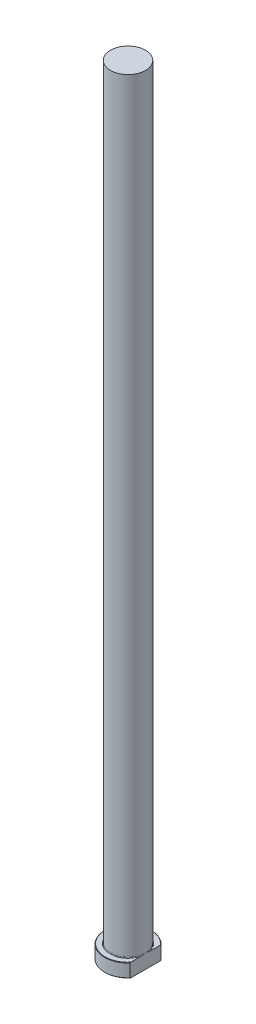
ISO-10303-21;
HEADER;
FILE_DESCRIPTION(('STEP AP214'),'2;1');
FILE_NAME('part.step','',(''),(''),'','','');
FILE_SCHEMA(('AUTOMOTIVE_DESIGN { 1 0 10303 214 1 1 1 1 }'));
ENDSEC;
DATA;
#1=APPLICATION_CONTEXT('core data for automotive mechanical design processes');
#2=APPLICATION_PROTOCOL_DEFINITION('international standard','automotive_design',2000,#1);
#3=PRODUCT_CONTEXT('',#1,'mechanical');
#4=PRODUCT('Part','Part','',(#3));
#5=PRODUCT_RELATED_PRODUCT_CATEGORY('part','',(#4));
#6=PRODUCT_DEFINITION_FORMATION('','',#4);
#7=PRODUCT_DEFINITION_CONTEXT('part definition',#1,'design');
#8=PRODUCT_DEFINITION('design','',#6,#7);
#9=PRODUCT_DEFINITION_SHAPE('','',#8);
#10=(LENGTH_UNIT() NAMED_UNIT(*) SI_UNIT(.MILLI.,.METRE.));
#11=(NAMED_UNIT(*) PLANE_ANGLE_UNIT() SI_UNIT($,.RADIAN.));
#12=(NAMED_UNIT(*) SI_UNIT($,.STERADIAN.) SOLID_ANGLE_UNIT());
#13=UNCERTAINTY_MEASURE_WITH_UNIT(LENGTH_MEASURE(1.E-05),#10,'distance_accuracy_value','');
#14=(GEOMETRIC_REPRESENTATION_CONTEXT(3) GLOBAL_UNCERTAINTY_ASSIGNED_CONTEXT((#13)) GLOBAL_UNIT_ASSIGNED_CONTEXT((#10,
#11,#12)) REPRESENTATION_CONTEXT('',''));
#15=CARTESIAN_POINT('',(0.,0.,0.));
#16=DIRECTION('',(0.,0.,1.));
#17=DIRECTION('',(1.,0.,0.));
#18=AXIS2_PLACEMENT_3D('',#15,#16,#17);
#19=CARTESIAN_POINT('',(0.,0.,0.));
#20=DIRECTION('',(0.,-1.,0.));
#21=DIRECTION('',(0.,0.,-1.));
#22=AXIS2_PLACEMENT_3D('',#19,#20,#21);
#23=PLANE('',#22);
#24=CARTESIAN_POINT('',(0.,0.,0.));
#25=DIRECTION('',(0.,-1.,0.));
#26=DIRECTION('',(0.,0.,-1.));
#27=AXIS2_PLACEMENT_3D('',#24,#25,#26);
#28=CIRCLE('',#27,11.8);
#29=CARTESIAN_POINT('',(8.99999999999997,0.,7.63151361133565));
#30=VERTEX_POINT('',#29);
#31=CARTESIAN_POINT('',(8.99999999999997,0.,-7.63151361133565));
#32=VERTEX_POINT('',#31);
#33=EDGE_CURVE('E98',#30,#32,#28,.T.);
#34=ORIENTED_EDGE('',*,*,#33,.T.);
#35=DIRECTION('',(0.,0.,1.));
#36=VECTOR('',#35,1.);
#37=CARTESIAN_POINT('',(8.99999999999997,0.,-7.93725393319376));
#38=LINE('',#37,#36);
#39=EDGE_CURVE('E83',#32,#30,#38,.T.);
#40=ORIENTED_EDGE('',*,*,#39,.T.);
#41=EDGE_LOOP('',(#34,#40));
#42=FACE_BOUND('',#41,.T.);
#43=ADVANCED_FACE('F32',(#42),#23,.T.);
#44=CARTESIAN_POINT('',(0.,259.958771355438,0.));
#45=DIRECTION('',(0.,1.,0.));
#46=DIRECTION('',(0.,0.,1.));
#47=AXIS2_PLACEMENT_3D('',#44,#45,#46);
#48=CYLINDRICAL_SURFACE('',#47,12.);
#49=CARTESIAN_POINT('',(0.,6.80000000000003,0.));
#50=DIRECTION('',(0.,1.,0.));
#51=DIRECTION('',(0.,0.,1.));
#52=AXIS2_PLACEMENT_3D('',#49,#50,#51);
#53=CIRCLE('',#52,12.);
#54=CARTESIAN_POINT('',(8.99999999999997,6.80000000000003,7.93725393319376));
#55=VERTEX_POINT('',#54);
#56=CARTESIAN_POINT('',(8.99999999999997,6.80000000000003,-7.93725393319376));
#57=VERTEX_POINT('',#56);
#58=EDGE_CURVE('E104',#55,#57,#53,.F.);
#59=ORIENTED_EDGE('',*,*,#58,.T.);
#60=DIRECTION('',(0.,-1.,0.));
#61=VECTOR('',#60,1.);
#62=CARTESIAN_POINT('',(8.99999999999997,400.,-7.93725393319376));
#63=LINE('',#62,#61);
#64=CARTESIAN_POINT('',(8.99999999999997,0.199999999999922,-7.93725393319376));
#65=VERTEX_POINT('',#64);
#66=EDGE_CURVE('E183',#57,#65,#63,.T.);
#67=ORIENTED_EDGE('',*,*,#66,.T.);
#68=CARTESIAN_POINT('',(0.,0.199999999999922,0.));
#69=DIRECTION('',(0.,-1.,0.));
#70=DIRECTION('',(0.,0.,-1.));
#71=AXIS2_PLACEMENT_3D('',#68,#69,#70);
#72=CIRCLE('',#71,12.);
#73=CARTESIAN_POINT('',(8.99999999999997,0.199999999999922,7.93725393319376));
#74=VERTEX_POINT('',#73);
#75=EDGE_CURVE('E100',#65,#74,#72,.F.);
#76=ORIENTED_EDGE('',*,*,#75,.T.);
#77=DIRECTION('',(0.,-1.,0.));
#78=VECTOR('',#77,1.);
#79=CARTESIAN_POINT('',(8.99999999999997,400.,7.93725393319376));
#80=LINE('',#79,#78);
#81=EDGE_CURVE('E93',#55,#74,#80,.T.);
#82=ORIENTED_EDGE('',*,*,#81,.F.);
#83=EDGE_LOOP('',(#59,#67,#76,#82));
#84=FACE_BOUND('',#83,.T.);
#85=ADVANCED_FACE('F158',(#84),#48,.T.);
#86=CARTESIAN_POINT('',(-12.,7.,0.));
#87=DIRECTION('',(0.,1.,0.));
#88=DIRECTION('',(0.,0.,1.));
#89=AXIS2_PLACEMENT_3D('',#86,#87,#88);
#90=PLANE('',#89);
#91=CARTESIAN_POINT('',(0.,7.,0.));
#92=DIRECTION('',(0.,1.,0.));
#93=DIRECTION('',(0.,0.,1.));
#94=AXIS2_PLACEMENT_3D('',#91,#92,#93);
#95=CIRCLE('',#94,11.8);
#96=CARTESIAN_POINT('',(8.99999999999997,7.,-7.63151361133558));
#97=VERTEX_POINT('',#96);
#98=CARTESIAN_POINT('',(8.99999999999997,7.,7.63151361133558));
#99=VERTEX_POINT('',#98);
#100=EDGE_CURVE('E178',#97,#99,#95,.T.);
#101=ORIENTED_EDGE('',*,*,#100,.T.);
#102=DIRECTION('',(0.,0.,-1.));
#103=VECTOR('',#102,1.);
#104=CARTESIAN_POINT('',(8.99999999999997,7.,0.));
#105=LINE('',#104,#103);
#106=CARTESIAN_POINT('',(8.99999999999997,6.99999999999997,2.34307490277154));
#107=VERTEX_POINT('',#106);
#108=EDGE_CURVE('E57',#99,#107,#105,.T.);
#109=ORIENTED_EDGE('',*,*,#108,.T.);
#110=CARTESIAN_POINT('',(0.,7.,0.));
#111=DIRECTION('',(0.,1.,0.));
#112=DIRECTION('',(0.,0.,1.));
#113=AXIS2_PLACEMENT_3D('',#110,#111,#112);
#114=CIRCLE('',#113,9.29999999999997);
#115=CARTESIAN_POINT('',(8.99999999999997,6.99999999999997,-2.34307490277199));
#116=VERTEX_POINT('',#115);
#117=EDGE_CURVE('E107',#107,#116,#114,.F.);
#118=ORIENTED_EDGE('',*,*,#117,.T.);
#119=EDGE_CURVE('E136',#116,#97,#105,.T.);
#120=ORIENTED_EDGE('',*,*,#119,.T.);
#121=EDGE_LOOP('',(#101,#109,#118,#120));
#122=FACE_BOUND('',#121,.T.);
#123=ADVANCED_FACE('F147',(#122),#90,.T.);
#124=CARTESIAN_POINT('',(0.,7.00000000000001,0.));
#125=DIRECTION('',(0.,-1.,0.));
#126=DIRECTION('',(0.,0.,-1.));
#127=AXIS2_PLACEMENT_3D('',#124,#125,#126);
#128=CONICAL_SURFACE('',#127,11.8,0.785398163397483);
#129=ORIENTED_EDGE('',*,*,#58,.F.);
#130=CARTESIAN_POINT('',(8.99999999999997,-0.845696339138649,17.4629145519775));
#131=CARTESIAN_POINT('',(8.99999999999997,-0.619168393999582,17.2080654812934));
#132=CARTESIAN_POINT('',(8.99999999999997,-0.393215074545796,16.9527052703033));
#133=CARTESIAN_POINT('',(8.99999999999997,0.0573779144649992,16.4408231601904));
#134=CARTESIAN_POINT('',(8.99999999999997,0.282017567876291,16.1843012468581));
#135=CARTESIAN_POINT('',(8.99999999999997,0.953874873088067,15.4126051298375));
#136=CARTESIAN_POINT('',(8.99999999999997,1.39886493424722,14.8954867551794));
#137=CARTESIAN_POINT('',(8.99999999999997,2.2870733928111,13.8475750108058));
#138=CARTESIAN_POINT('',(8.99999999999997,2.7301856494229,13.3166913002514));
#139=CARTESIAN_POINT('',(8.99999999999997,3.38667359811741,12.5137605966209));
#140=CARTESIAN_POINT('',(8.99999999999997,3.60411991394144,12.245041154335));
#141=CARTESIAN_POINT('',(8.99999999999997,4.03580182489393,11.7050379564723));
#142=CARTESIAN_POINT('',(8.99999999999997,4.25003746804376,11.4337542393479));
#143=CARTESIAN_POINT('',(8.99999999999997,4.66485476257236,10.9008707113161));
#144=CARTESIAN_POINT('',(8.99999999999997,4.86560885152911,10.6394052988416));
#145=CARTESIAN_POINT('',(8.99999999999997,5.26299613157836,10.1133666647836));
#146=CARTESIAN_POINT('',(8.99999999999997,5.45962943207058,9.84879352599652));
#147=CARTESIAN_POINT('',(8.99999999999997,5.84808590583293,9.31586751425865));
#148=CARTESIAN_POINT('',(8.99999999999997,6.03990586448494,9.04751229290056));
#149=CARTESIAN_POINT('',(8.99999999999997,6.41755379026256,8.50661357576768));
#150=CARTESIAN_POINT('',(8.99999999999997,6.60338186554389,8.23407015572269));
#151=CARTESIAN_POINT('',(8.99999999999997,6.96709703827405,7.68503423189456));
#152=CARTESIAN_POINT('',(8.99999999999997,7.14500871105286,7.40855806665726));
#153=CARTESIAN_POINT('',(8.99999999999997,7.49185621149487,6.84996824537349));
#154=CARTESIAN_POINT('',(8.99999999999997,7.66079116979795,6.56785404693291));
#155=CARTESIAN_POINT('',(8.99999999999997,7.9872710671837,5.99747808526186));
#156=CARTESIAN_POINT('',(8.99999999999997,8.14482812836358,5.70922330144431));
#157=CARTESIAN_POINT('',(8.99999999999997,8.4458607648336,5.12549650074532));
#158=CARTESIAN_POINT('',(8.99999999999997,8.5893404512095,4.83002662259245));
#159=CARTESIAN_POINT('',(8.99999999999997,8.84906483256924,4.2523887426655));
#160=CARTESIAN_POINT('',(8.99999999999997,8.96652090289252,3.97076984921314));
#161=CARTESIAN_POINT('',(8.99999999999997,9.18268640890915,3.40034514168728));
#162=CARTESIAN_POINT('',(8.99999999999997,9.28139598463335,3.11153938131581));
#163=CARTESIAN_POINT('',(8.99999999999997,9.45566763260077,2.52852903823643));
#164=CARTESIAN_POINT('',(8.99999999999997,9.53134480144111,2.23435935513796));
#165=CARTESIAN_POINT('',(8.99999999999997,9.6563257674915,1.64041484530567));
#166=CARTESIAN_POINT('',(8.99999999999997,9.70563300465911,1.34064075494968));
#167=CARTESIAN_POINT('',(8.99999999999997,9.77526514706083,0.73345334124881));
#168=CARTESIAN_POINT('',(8.99999999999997,9.79517814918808,0.425991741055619));
#169=CARTESIAN_POINT('',(8.99999999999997,9.80326622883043,-0.189338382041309));
#170=CARTESIAN_POINT('',(8.99999999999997,9.79144305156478,-0.497206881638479));
#171=CARTESIAN_POINT('',(8.99999999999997,9.73685194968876,-1.11106012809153));
#172=CARTESIAN_POINT('',(8.99999999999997,9.69399186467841,-1.41703652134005));
#173=CARTESIAN_POINT('',(8.99999999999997,9.58011156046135,-2.02367348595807));
#174=CARTESIAN_POINT('',(8.99999999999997,9.50908374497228,-2.32433260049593));
#175=CARTESIAN_POINT('',(8.99999999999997,9.31275981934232,-3.02635448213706));
#176=CARTESIAN_POINT('',(8.99999999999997,9.17712713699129,-3.42480429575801));
#177=CARTESIAN_POINT('',(8.99999999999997,8.87133996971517,-4.20817933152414));
#178=CARTESIAN_POINT('',(8.99999999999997,8.70116358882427,-4.59309579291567));
#179=CARTESIAN_POINT('',(8.99999999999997,8.42568509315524,-5.16277807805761));
#180=CARTESIAN_POINT('',(8.99999999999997,8.32997694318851,-5.35228814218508));
#181=CARTESIAN_POINT('',(8.99999999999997,8.13285287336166,-5.72832390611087));
#182=CARTESIAN_POINT('',(8.99999999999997,8.03143692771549,-5.9148495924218));
#183=CARTESIAN_POINT('',(8.99999999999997,7.82372693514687,-6.28506428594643));
#184=CARTESIAN_POINT('',(8.99999999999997,7.71743466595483,-6.46875429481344));
#185=CARTESIAN_POINT('',(8.99999999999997,7.50059460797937,-6.83359939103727));
#186=CARTESIAN_POINT('',(8.99999999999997,7.39004682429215,-7.01475448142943));
#187=CARTESIAN_POINT('',(8.99999999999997,7.12884885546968,-7.43306414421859));
#188=CARTESIAN_POINT('',(8.99999999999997,6.97680815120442,-7.66934990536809));
#189=CARTESIAN_POINT('',(8.99999999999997,6.66732030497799,-8.13836281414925));
#190=CARTESIAN_POINT('',(8.99999999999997,6.50987281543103,-8.37108973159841));
#191=CARTESIAN_POINT('',(8.99999999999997,6.19040265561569,-8.83345273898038));
#192=CARTESIAN_POINT('',(8.99999999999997,6.02837897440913,-9.06308812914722));
#193=CARTESIAN_POINT('',(8.99999999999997,5.70047733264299,-9.51959402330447));
#194=CARTESIAN_POINT('',(8.99999999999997,5.53459926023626,-9.74646444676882));
#195=CARTESIAN_POINT('',(8.99999999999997,5.03154469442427,-10.424124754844));
#196=CARTESIAN_POINT('',(8.99999999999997,4.68944039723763,-10.8712583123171));
#197=CARTESIAN_POINT('',(8.99999999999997,3.99558068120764,-11.7578381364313));
#198=CARTESIAN_POINT('',(8.99999999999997,3.64382644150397,-12.1972853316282));
#199=CARTESIAN_POINT('',(8.99999999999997,2.95317269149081,-13.0452636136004));
#200=CARTESIAN_POINT('',(8.99999999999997,2.61468309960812,-13.4541293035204));
#201=CARTESIAN_POINT('',(8.99999999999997,1.93249184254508,-14.2675092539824));
#202=CARTESIAN_POINT('',(8.99999999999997,1.58878996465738,-14.6720233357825));
#203=CARTESIAN_POINT('',(8.99999999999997,0.898519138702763,-15.4759626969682));
#204=CARTESIAN_POINT('',(8.99999999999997,0.551965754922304,-15.8754013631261));
#205=CARTESIAN_POINT('',(8.99999999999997,-0.144511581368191,-16.6712645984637));
#206=CARTESIAN_POINT('',(8.99999999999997,-0.49443521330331,-17.0676894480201));
#207=CARTESIAN_POINT('',(8.99999999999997,-0.845696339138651,-17.4629145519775));
#208=B_SPLINE_CURVE_WITH_KNOTS('',3,(#130,#131,#132,#133,#134,#135,#136,#137,#138,#139,#140,
#141,#142,#143,#144,#145,#146,#147,#148,#149,#150,#151,#152,#153,#154,#155,#156,#157,#158,#159,
#160,#161,#162,#163,#164,#165,#166,#167,#168,#169,#170,#171,#172,#173,#174,#175,#176,#177,#178,
#179,#180,#181,#182,#183,#184,#185,#186,#187,#188,#189,#190,#191,#192,#193,#194,#195,#196,#197,
#198,#199,#200,#201,#202,#203,#204,#205,#206,#207),.UNSPECIFIED.,.F.,.F.,(4,2,2,2,2,2,2,2,2,2,2,
2,2,2,2,2,2,2,2,2,2,2,2,2,2,2,2,2,2,2,2,2,2,2,2,2,2,2,4),(0.,1.02291971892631,2.0458519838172,
4.09246471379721,6.16687312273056,7.20388686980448,8.24088509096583,9.22978878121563,
10.2186661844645,11.2081873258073,12.1976905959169,13.1838703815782,14.1701455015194,
15.1553538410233,16.1402736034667,17.0551241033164,17.9699677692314,18.8801617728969,
19.7902370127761,20.7129479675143,21.6356081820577,22.5610194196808,23.486680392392,
24.7471780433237,26.0084771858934,26.6453205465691,27.2821667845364,27.9187826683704,
28.5553977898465,29.3982316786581,30.2411198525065,31.0841957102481,31.9272960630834,
33.6160766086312,35.3046517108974,36.8969911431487,38.4893957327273,40.0758348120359,
41.6621244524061),.UNSPECIFIED.);
#209=EDGE_CURVE('E135',#55,#99,#208,.T.);
#210=ORIENTED_EDGE('',*,*,#209,.T.);
#211=ORIENTED_EDGE('',*,*,#100,.F.);
#212=EDGE_CURVE('E127',#97,#57,#208,.T.);
#213=ORIENTED_EDGE('',*,*,#212,.T.);
#214=EDGE_LOOP('',(#129,#210,#211,#213));
#215=FACE_BOUND('',#214,.T.);
#216=ADVANCED_FACE('F143',(#215),#128,.T.);
#217=CARTESIAN_POINT('',(0.,0.199999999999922,0.));
#218=DIRECTION('',(0.,1.,0.));
#219=DIRECTION('',(0.,0.,1.));
#220=AXIS2_PLACEMENT_3D('',#217,#218,#219);
#221=CONICAL_SURFACE('',#220,12.,0.785398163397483);
#222=ORIENTED_EDGE('',*,*,#75,.F.);
#223=CARTESIAN_POINT('',(8.99999999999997,7.8456963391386,-17.4629145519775));
#224=CARTESIAN_POINT('',(8.99999999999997,7.61916839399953,-17.2080654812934));
#225=CARTESIAN_POINT('',(8.99999999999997,7.39321507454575,-16.9527052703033));
#226=CARTESIAN_POINT('',(8.99999999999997,6.94262208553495,-16.4408231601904));
#227=CARTESIAN_POINT('',(8.99999999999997,6.71798243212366,-16.1843012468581));
#228=CARTESIAN_POINT('',(8.99999999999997,6.04612512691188,-15.4126051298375));
#229=CARTESIAN_POINT('',(8.99999999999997,5.60113506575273,-14.8954867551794));
#230=CARTESIAN_POINT('',(8.99999999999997,4.71292660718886,-13.8475750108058));
#231=CARTESIAN_POINT('',(8.99999999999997,4.26981435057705,-13.3166913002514));
#232=CARTESIAN_POINT('',(8.99999999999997,3.61332640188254,-12.5137605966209));
#233=CARTESIAN_POINT('',(8.99999999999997,3.39588008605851,-12.245041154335));
#234=CARTESIAN_POINT('',(8.99999999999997,2.96419817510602,-11.7050379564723));
#235=CARTESIAN_POINT('',(8.99999999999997,2.74996253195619,-11.4337542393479));
#236=CARTESIAN_POINT('',(8.99999999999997,2.33514523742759,-10.9008707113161));
#237=CARTESIAN_POINT('',(8.99999999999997,2.13439114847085,-10.6394052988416));
#238=CARTESIAN_POINT('',(8.99999999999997,1.73700386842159,-10.1133666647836));
#239=CARTESIAN_POINT('',(8.99999999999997,1.54037056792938,-9.84879352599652));
#240=CARTESIAN_POINT('',(8.99999999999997,1.15191409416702,-9.31586751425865));
#241=CARTESIAN_POINT('',(8.99999999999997,0.960094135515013,-9.04751229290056));
#242=CARTESIAN_POINT('',(8.99999999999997,0.582446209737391,-8.50661357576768));
#243=CARTESIAN_POINT('',(8.99999999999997,0.396618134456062,-8.23407015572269));
#244=CARTESIAN_POINT('',(8.99999999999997,0.0329029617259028,-7.68503423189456));
#245=CARTESIAN_POINT('',(8.99999999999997,-0.145008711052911,-7.40855806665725));
#246=CARTESIAN_POINT('',(8.99999999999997,-0.491856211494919,-6.84996824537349));
#247=CARTESIAN_POINT('',(8.99999999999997,-0.660791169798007,-6.56785404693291));
#248=CARTESIAN_POINT('',(8.99999999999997,-0.98727106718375,-5.99747808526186));
#249=CARTESIAN_POINT('',(8.99999999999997,-1.14482812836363,-5.70922330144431));
#250=CARTESIAN_POINT('',(8.99999999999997,-1.44586076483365,-5.12549650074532));
#251=CARTESIAN_POINT('',(8.99999999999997,-1.58934045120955,-4.83002662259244));
#252=CARTESIAN_POINT('',(8.99999999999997,-1.84906483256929,-4.2523887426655));
#253=CARTESIAN_POINT('',(8.99999999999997,-1.96652090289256,-3.97076984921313));
#254=CARTESIAN_POINT('',(8.99999999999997,-2.1826864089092,-3.40034514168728));
#255=CARTESIAN_POINT('',(8.99999999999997,-2.2813959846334,-3.1115393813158));
#256=CARTESIAN_POINT('',(8.99999999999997,-2.45566763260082,-2.52852903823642));
#257=CARTESIAN_POINT('',(8.99999999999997,-2.53134480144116,-2.23435935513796));
#258=CARTESIAN_POINT('',(8.99999999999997,-2.65632576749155,-1.64041484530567));
#259=CARTESIAN_POINT('',(8.99999999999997,-2.70563300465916,-1.34064075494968));
#260=CARTESIAN_POINT('',(8.99999999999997,-2.77526514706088,-0.733453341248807));
#261=CARTESIAN_POINT('',(8.99999999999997,-2.79517814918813,-0.425991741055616));
#262=CARTESIAN_POINT('',(8.99999999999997,-2.80326622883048,0.189338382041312));
#263=CARTESIAN_POINT('',(8.99999999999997,-2.79144305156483,0.497206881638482));
#264=CARTESIAN_POINT('',(8.99999999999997,-2.73685194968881,1.11106012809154));
#265=CARTESIAN_POINT('',(8.99999999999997,-2.69399186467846,1.41703652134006));
#266=CARTESIAN_POINT('',(8.99999999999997,-2.58011156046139,2.02367348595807));
#267=CARTESIAN_POINT('',(8.99999999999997,-2.50908374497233,2.32433260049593));
#268=CARTESIAN_POINT('',(8.99999999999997,-2.31275981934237,3.02635448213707));
#269=CARTESIAN_POINT('',(8.99999999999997,-2.17712713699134,3.42480429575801));
#270=CARTESIAN_POINT('',(8.99999999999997,-1.87133996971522,4.20817933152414));
#271=CARTESIAN_POINT('',(8.99999999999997,-1.70116358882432,4.59309579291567));
#272=CARTESIAN_POINT('',(8.99999999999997,-1.42568509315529,5.16277807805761));
#273=CARTESIAN_POINT('',(8.99999999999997,-1.32997694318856,5.35228814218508));
#274=CARTESIAN_POINT('',(8.99999999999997,-1.13285287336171,5.72832390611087));
#275=CARTESIAN_POINT('',(8.99999999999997,-1.03143692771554,5.9148495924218));
#276=CARTESIAN_POINT('',(8.99999999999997,-0.823726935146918,6.28506428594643));
#277=CARTESIAN_POINT('',(8.99999999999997,-0.717434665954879,6.46875429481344));
#278=CARTESIAN_POINT('',(8.99999999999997,-0.500594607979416,6.83359939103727));
#279=CARTESIAN_POINT('',(8.99999999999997,-0.390046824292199,7.01475448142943));
#280=CARTESIAN_POINT('',(8.99999999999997,-0.128848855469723,7.4330641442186));
#281=CARTESIAN_POINT('',(8.99999999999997,0.0231918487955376,7.6693499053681));
#282=CARTESIAN_POINT('',(8.99999999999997,0.332679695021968,8.13836281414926));
#283=CARTESIAN_POINT('',(8.99999999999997,0.490127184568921,8.37108973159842));
#284=CARTESIAN_POINT('',(8.99999999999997,0.809597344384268,8.83345273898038));
#285=CARTESIAN_POINT('',(8.99999999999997,0.971621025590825,9.06308812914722));
#286=CARTESIAN_POINT('',(8.99999999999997,1.29952266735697,9.51959402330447));
#287=CARTESIAN_POINT('',(8.99999999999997,1.46540073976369,9.74646444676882));
#288=CARTESIAN_POINT('',(8.99999999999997,1.96845530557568,10.424124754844));
#289=CARTESIAN_POINT('',(8.99999999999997,2.31055960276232,10.8712583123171));
#290=CARTESIAN_POINT('',(8.99999999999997,3.00441931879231,11.7578381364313));
#291=CARTESIAN_POINT('',(8.99999999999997,3.35617355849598,12.1972853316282));
#292=CARTESIAN_POINT('',(8.99999999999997,4.04682730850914,13.0452636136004));
#293=CARTESIAN_POINT('',(8.99999999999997,4.38531690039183,13.4541293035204));
#294=CARTESIAN_POINT('',(8.99999999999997,5.06750815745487,14.2675092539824));
#295=CARTESIAN_POINT('',(8.99999999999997,5.41121003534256,14.6720233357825));
#296=CARTESIAN_POINT('',(8.99999999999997,6.10148086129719,15.4759626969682));
#297=CARTESIAN_POINT('',(8.99999999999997,6.44803424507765,15.8754013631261));
#298=CARTESIAN_POINT('',(8.99999999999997,7.14451158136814,16.6712645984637));
#299=CARTESIAN_POINT('',(8.99999999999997,7.49443521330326,17.0676894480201));
#300=CARTESIAN_POINT('',(8.99999999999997,7.8456963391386,17.4629145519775));
#301=B_SPLINE_CURVE_WITH_KNOTS('',3,(#223,#224,#225,#226,#227,#228,#229,#230,#231,#232,#233,
#234,#235,#236,#237,#238,#239,#240,#241,#242,#243,#244,#245,#246,#247,#248,#249,#250,#251,#252,
#253,#254,#255,#256,#257,#258,#259,#260,#261,#262,#263,#264,#265,#266,#267,#268,#269,#270,#271,
#272,#273,#274,#275,#276,#277,#278,#279,#280,#281,#282,#283,#284,#285,#286,#287,#288,#289,#290,
#291,#292,#293,#294,#295,#296,#297,#298,#299,#300),.UNSPECIFIED.,.F.,.F.,(4,2,2,2,2,2,2,2,2,2,2,
2,2,2,2,2,2,2,2,2,2,2,2,2,2,2,2,2,2,2,2,2,2,2,2,2,2,2,4),(0.,1.02291971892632,2.0458519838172,
4.09246471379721,6.16687312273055,7.20388686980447,8.24088509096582,9.22978878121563,
10.2186661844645,11.2081873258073,12.1976905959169,13.1838703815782,14.1701455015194,
15.1553538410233,16.1402736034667,17.0551241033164,17.9699677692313,18.8801617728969,
19.7902370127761,20.7129479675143,21.6356081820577,22.5610194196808,23.486680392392,
24.7471780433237,26.0084771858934,26.6453205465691,27.2821667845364,27.9187826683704,
28.5553977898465,29.3982316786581,30.2411198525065,31.0841957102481,31.9272960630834,
33.6160766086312,35.3046517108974,36.8969911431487,38.4893957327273,40.0758348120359,
41.6621244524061),.UNSPECIFIED.);
#302=EDGE_CURVE('E86',#65,#32,#301,.T.);
#303=ORIENTED_EDGE('',*,*,#302,.T.);
#304=ORIENTED_EDGE('',*,*,#33,.F.);
#305=EDGE_CURVE('E89',#30,#74,#301,.T.);
#306=ORIENTED_EDGE('',*,*,#305,.T.);
#307=EDGE_LOOP('',(#222,#303,#304,#306));
#308=FACE_BOUND('',#307,.T.);
#309=ADVANCED_FACE('F97',(#308),#221,.T.);
#310=CARTESIAN_POINT('',(0.,7.29999999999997,0.));
#311=DIRECTION('',(0.,1.,0.));
#312=DIRECTION('',(0.,0.,1.));
#313=AXIS2_PLACEMENT_3D('',#310,#311,#312);
#314=TOROIDAL_SURFACE('',#313,9.29999999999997,0.3);
#315=CARTESIAN_POINT('',(8.99999999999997,7.29999999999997,0.));
#316=CARTESIAN_POINT('',(8.99999999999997,7.30000063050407,1.40628521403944E-10));
#317=CARTESIAN_POINT('',(8.99999999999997,7.30000126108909,-3.72953344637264E-07));
#318=CARTESIAN_POINT('',(8.99999999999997,7.30000242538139,-1.31879172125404E-06));
#319=CARTESIAN_POINT('',(8.99999999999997,7.30000291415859,-1.91658985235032E-06));
#320=CARTESIAN_POINT('',(8.99999999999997,7.30000399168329,-3.38116402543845E-06));
#321=CARTESIAN_POINT('',(8.99999999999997,7.30000455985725,-4.27141237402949E-06));
#322=CARTESIAN_POINT('',(8.99999999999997,7.30000552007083,-6.05655817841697E-06));
#323=CARTESIAN_POINT('',(8.99999999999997,7.30000592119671,-6.9473471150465E-06));
#324=CARTESIAN_POINT('',(8.99999999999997,7.30000753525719,-1.06072217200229E-05));
#325=CARTESIAN_POINT('',(8.99999999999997,7.30000869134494,-1.34079715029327E-05));
#326=CARTESIAN_POINT('',(8.99999999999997,7.30001046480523,-1.87883419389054E-05));
#327=CARTESIAN_POINT('',(8.99999999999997,7.30001113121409,-2.13522964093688E-05));
#328=CARTESIAN_POINT('',(8.99999999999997,7.30001412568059,-3.27400407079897E-05));
#329=CARTESIAN_POINT('',(8.99999999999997,7.30001653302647,-4.15431816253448E-05));
#330=CARTESIAN_POINT('',(8.99999999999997,7.30001987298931,-5.77938726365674E-05));
#331=CARTESIAN_POINT('',(8.99999999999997,7.3000209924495,-6.5202010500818E-05));
#332=CARTESIAN_POINT('',(8.99999999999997,7.30002942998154,-0.000121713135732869));
#333=CARTESIAN_POINT('',(8.99999999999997,7.30003617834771,-0.000170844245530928));
#334=CARTESIAN_POINT('',(8.99999999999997,7.30006567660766,-0.00036702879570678));
#335=CARTESIAN_POINT('',(8.99999999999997,7.30009343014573,-0.00051334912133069));
#336=CARTESIAN_POINT('',(8.99999999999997,7.30020289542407,-0.00109844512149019));
#337=CARTESIAN_POINT('',(8.99999999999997,7.30028164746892,-0.00153755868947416));
#338=CARTESIAN_POINT('',(8.99999999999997,7.30059984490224,-0.00330079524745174));
#339=CARTESIAN_POINT('',(8.99999999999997,7.30084318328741,-0.00462444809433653));
#340=CARTESIAN_POINT('',(8.99999999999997,7.30186346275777,-0.0101867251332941));
#341=CARTESIAN_POINT('',(8.99999999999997,7.30263548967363,-0.0144259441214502));
#342=CARTESIAN_POINT('',(8.99999999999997,7.31325744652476,-0.0727359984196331));
#343=CARTESIAN_POINT('',(8.99999999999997,7.32313962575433,-0.1268031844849));
#344=CARTESIAN_POINT('',(8.99999999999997,7.34392153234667,-0.241097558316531));
#345=CARTESIAN_POINT('',(8.99999999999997,7.35480932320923,-0.301326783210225));
#346=CARTESIAN_POINT('',(8.99999999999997,7.37309736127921,-0.40343148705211));
#347=CARTESIAN_POINT('',(8.99999999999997,7.3805477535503,-0.445297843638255));
#348=CARTESIAN_POINT('',(8.99999999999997,7.39510453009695,-0.527858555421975));
#349=CARTESIAN_POINT('',(8.99999999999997,7.40221466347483,-0.568552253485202));
#350=CARTESIAN_POINT('',(8.99999999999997,7.43458159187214,-0.755924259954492));
#351=CARTESIAN_POINT('',(8.99999999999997,7.45890071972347,-0.902767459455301));
#352=CARTESIAN_POINT('',(8.99999999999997,7.5040883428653,-1.19870226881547));
#353=CARTESIAN_POINT('',(8.99999999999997,7.52491482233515,-1.34780055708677));
#354=CARTESIAN_POINT('',(8.99999999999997,7.55251893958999,-1.57943061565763));
#355=CARTESIAN_POINT('',(8.99999999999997,7.56140010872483,-1.66170929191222));
#356=CARTESIAN_POINT('',(8.99999999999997,7.57684365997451,-1.82648173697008));
#357=CARTESIAN_POINT('',(8.99999999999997,7.58340627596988,-1.90897548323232));
#358=CARTESIAN_POINT('',(8.99999999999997,7.59356547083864,-2.07383798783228));
#359=CARTESIAN_POINT('',(8.99999999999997,7.59717316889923,-2.15620603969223));
#360=CARTESIAN_POINT('',(8.99999999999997,7.60060935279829,-2.32101209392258));
#361=CARTESIAN_POINT('',(8.99999999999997,7.60043940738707,-2.40345005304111));
#362=CARTESIAN_POINT('',(8.99999999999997,7.59640131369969,-2.52537573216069));
#363=CARTESIAN_POINT('',(8.99999999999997,7.59450012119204,-2.56492910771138));
#364=CARTESIAN_POINT('',(8.99999999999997,7.58928802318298,-2.64396909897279));
#365=CARTESIAN_POINT('',(8.99999999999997,7.58597630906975,-2.68345566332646));
#366=CARTESIAN_POINT('',(8.99999999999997,7.57769868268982,-2.76177296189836));
#367=CARTESIAN_POINT('',(8.99999999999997,7.57275348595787,-2.80060581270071));
#368=CARTESIAN_POINT('',(8.99999999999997,7.56078540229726,-2.87793166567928));
#369=CARTESIAN_POINT('',(8.99999999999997,7.55376374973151,-2.91642485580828));
#370=CARTESIAN_POINT('',(8.99999999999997,7.53694450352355,-2.99313780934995));
#371=CARTESIAN_POINT('',(8.99999999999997,7.52712658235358,-3.03135338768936));
#372=CARTESIAN_POINT('',(8.99999999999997,7.50944673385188,-3.08780831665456));
#373=CARTESIAN_POINT('',(8.99999999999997,7.50305127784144,-3.10650508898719));
#374=CARTESIAN_POINT('',(8.99999999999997,7.48902548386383,-3.14342466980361));
#375=CARTESIAN_POINT('',(8.99999999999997,7.48139609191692,-3.16164782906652));
#376=CARTESIAN_POINT('',(8.99999999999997,7.46450585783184,-3.19743301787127));
#377=CARTESIAN_POINT('',(8.99999999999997,7.4552376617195,-3.2149916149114));
#378=CARTESIAN_POINT('',(8.99999999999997,7.43454972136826,-3.24876333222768));
#379=CARTESIAN_POINT('',(8.99999999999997,7.42314087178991,-3.26498269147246));
#380=CARTESIAN_POINT('',(8.99999999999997,7.40450419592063,-3.28646803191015));
#381=CARTESIAN_POINT('',(8.99999999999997,7.39850345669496,-3.29278935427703));
#382=CARTESIAN_POINT('',(8.99999999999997,7.38579421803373,-3.30471156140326));
#383=CARTESIAN_POINT('',(8.99999999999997,7.37908470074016,-3.31031138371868));
#384=CARTESIAN_POINT('',(8.99999999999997,7.36478588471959,-3.32053638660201));
#385=CARTESIAN_POINT('',(8.99999999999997,7.35718475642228,-3.32514544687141));
#386=CARTESIAN_POINT('',(8.99999999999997,7.34122980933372,-3.33278362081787));
#387=CARTESIAN_POINT('',(8.99999999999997,7.33287931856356,-3.33581935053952));
#388=CARTESIAN_POINT('',(8.99999999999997,7.31845330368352,-3.33919143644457));
#389=CARTESIAN_POINT('',(8.99999999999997,7.3125065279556,-3.34008113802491));
#390=CARTESIAN_POINT('',(8.99999999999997,7.30054756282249,-3.34082795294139));
#391=CARTESIAN_POINT('',(8.99999999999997,7.29453539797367,-3.34068544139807));
#392=CARTESIAN_POINT('',(8.99999999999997,7.28263753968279,-3.33938340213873));
#393=CARTESIAN_POINT('',(8.99999999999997,7.2767516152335,-3.3382259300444));
#394=CARTESIAN_POINT('',(8.99999999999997,7.26523345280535,-3.33500803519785));
#395=CARTESIAN_POINT('',(8.99999999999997,7.25960143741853,-3.33294683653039));
#396=CARTESIAN_POINT('',(8.99999999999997,7.24614810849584,-3.32695048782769));
#397=CARTESIAN_POINT('',(8.99999999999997,7.23851777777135,-3.32258952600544));
#398=CARTESIAN_POINT('',(8.99999999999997,7.22402940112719,-3.31273429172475));
#399=CARTESIAN_POINT('',(8.99999999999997,7.21717355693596,-3.3072369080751));
#400=CARTESIAN_POINT('',(8.99999999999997,7.19922025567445,-3.29098261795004));
#401=CARTESIAN_POINT('',(8.99999999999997,7.18887056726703,-3.27940951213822));
#402=CARTESIAN_POINT('',(8.99999999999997,7.16988044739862,-3.25496698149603));
#403=CARTESIAN_POINT('',(8.99999999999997,7.16124389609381,-3.24209471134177));
#404=CARTESIAN_POINT('',(8.99999999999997,7.14198013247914,-3.2101081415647));
#405=CARTESIAN_POINT('',(8.99999999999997,7.1320002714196,-3.1906083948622));
#406=CARTESIAN_POINT('',(8.99999999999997,7.11389041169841,-3.15075380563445));
#407=CARTESIAN_POINT('',(8.99999999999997,7.10576438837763,-3.13039723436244));
#408=CARTESIAN_POINT('',(8.99999999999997,7.09086324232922,-3.08897345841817));
#409=CARTESIAN_POINT('',(8.99999999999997,7.08410231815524,-3.06790120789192));
#410=CARTESIAN_POINT('',(8.99999999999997,7.07174209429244,-3.02545099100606));
#411=CARTESIAN_POINT('',(8.99999999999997,7.06614150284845,-3.00407339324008));
#412=CARTESIAN_POINT('',(8.99999999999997,7.05234584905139,-2.94629140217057));
#413=CARTESIAN_POINT('',(8.99999999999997,7.04502112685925,-2.90967972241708));
#414=CARTESIAN_POINT('',(8.99999999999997,7.03240402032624,-2.8361022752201));
#415=CARTESIAN_POINT('',(8.99999999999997,7.02711280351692,-2.79913631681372));
#416=CARTESIAN_POINT('',(8.99999999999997,7.01363050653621,-2.68772710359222));
#417=CARTESIAN_POINT('',(8.99999999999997,7.00787651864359,-2.61298996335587));
#418=CARTESIAN_POINT('',(8.99999999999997,7.00101064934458,-2.46619763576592));
#419=CARTESIAN_POINT('',(8.99999999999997,6.99973066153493,-2.39414846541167));
#420=CARTESIAN_POINT('',(8.99999999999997,7.0003597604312,-2.25048360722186));
#421=CARTESIAN_POINT('',(8.99999999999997,7.00225057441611,-2.17886780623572));
#422=CARTESIAN_POINT('',(8.99999999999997,7.00865827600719,-2.0325544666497));
#423=CARTESIAN_POINT('',(8.99999999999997,7.01328875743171,-1.95786225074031));
#424=CARTESIAN_POINT('',(8.99999999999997,7.0247141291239,-1.80868969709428));
#425=CARTESIAN_POINT('',(8.99999999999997,7.03150781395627,-1.73420926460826));
#426=CARTESIAN_POINT('',(8.99999999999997,7.04702589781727,-1.583650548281));
#427=CARTESIAN_POINT('',(8.99999999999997,7.05579262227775,-1.50757669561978));
#428=CARTESIAN_POINT('',(8.99999999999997,7.07482366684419,-1.35540828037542));
#429=CARTESIAN_POINT('',(8.99999999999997,7.08509200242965,-1.27931422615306));
#430=CARTESIAN_POINT('',(8.99999999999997,7.11096614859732,-1.09814766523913));
#431=CARTESIAN_POINT('',(8.99999999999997,7.12710877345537,-0.993152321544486));
#432=CARTESIAN_POINT('',(8.99999999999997,7.16076002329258,-0.784642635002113));
#433=CARTESIAN_POINT('',(8.99999999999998,7.17825049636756,-0.681125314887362));
#434=CARTESIAN_POINT('',(8.99999999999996,7.21207189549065,-0.486473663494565));
#435=CARTESIAN_POINT('',(8.99999999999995,7.22829584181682,-0.395320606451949));
#436=CARTESIAN_POINT('',(8.99999999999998,7.25335230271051,-0.256199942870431));
#437=CARTESIAN_POINT('',(9.,7.26204965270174,-0.208207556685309));
#438=CARTESIAN_POINT('',(8.99999999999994,7.27937243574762,-0.113033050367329));
#439=CARTESIAN_POINT('',(8.99999999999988,7.2879966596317,-0.0658507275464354));
#440=CARTESIAN_POINT('',(8.99999999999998,7.29736684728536,-0.0144131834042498));
#441=CARTESIAN_POINT('',(8.99999999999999,7.29814117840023,-0.0101611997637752));
#442=CARTESIAN_POINT('',(8.99999999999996,7.29916198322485,-0.00459610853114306));
#443=CARTESIAN_POINT('',(8.99999999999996,7.29940349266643,-0.00328239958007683));
#444=CARTESIAN_POINT('',(8.99999999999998,7.29971946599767,-0.00153148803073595));
#445=CARTESIAN_POINT('',(8.99999999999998,7.2997977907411,-0.00109475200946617));
#446=CARTESIAN_POINT('',(8.99999999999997,7.29990674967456,-0.000512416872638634));
#447=CARTESIAN_POINT('',(8.99999999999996,7.29993443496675,-0.000366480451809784));
#448=CARTESIAN_POINT('',(8.99999999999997,7.29996386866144,-0.00017073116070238));
#449=CARTESIAN_POINT('',(8.99999999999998,7.29997060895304,-0.000121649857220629));
#450=CARTESIAN_POINT('',(8.99999999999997,7.29997903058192,-6.51901500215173E-05));
#451=CARTESIAN_POINT('',(8.99999999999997,7.29998014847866,-5.7784383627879E-05));
#452=CARTESIAN_POINT('',(8.99999999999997,7.29998348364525,-4.15389236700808E-05));
#453=CARTESIAN_POINT('',(8.99999999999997,7.29998588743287,-3.27385309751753E-05));
#454=CARTESIAN_POINT('',(8.99999999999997,7.29998887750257,-2.13537218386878E-05));
#455=CARTESIAN_POINT('',(8.99999999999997,7.29998954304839,-1.87899411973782E-05));
#456=CARTESIAN_POINT('',(8.99999999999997,7.29999131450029,-1.34098146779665E-05));
#457=CARTESIAN_POINT('',(8.99999999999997,7.29999246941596,-1.0609109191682E-05));
#458=CARTESIAN_POINT('',(8.99999999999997,7.29999408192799,-6.94916941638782E-06));
#459=CARTESIAN_POINT('',(8.99999999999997,7.29999448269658,-6.05831006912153E-06));
#460=CARTESIAN_POINT('',(8.99999999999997,7.29999544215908,-4.27295929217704E-06));
#461=CARTESIAN_POINT('',(8.99999999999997,7.29999600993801,-3.38257168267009E-06));
#462=CARTESIAN_POINT('',(8.99999999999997,7.29999708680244,-1.91768845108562E-06));
#463=CARTESIAN_POINT('',(8.99999999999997,7.29999757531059,-1.3197344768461E-06));
#464=CARTESIAN_POINT('',(8.99999999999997,7.29999873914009,-3.73475936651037E-07));
#465=CARTESIAN_POINT('',(8.99999999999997,7.29999936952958,-1.40621003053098E-10));
#466=CARTESIAN_POINT('',(8.99999999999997,7.29999999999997,0.));
#467=B_SPLINE_CURVE_WITH_KNOTS('',3,(#315,#316,#317,#318,#319,#320,#321,#322,#323,#324,#325,
#326,#327,#328,#329,#330,#331,#332,#333,#334,#335,#336,#337,#338,#339,#340,#341,#342,#343,#344,
#345,#346,#347,#348,#349,#350,#351,#352,#353,#354,#355,#356,#357,#358,#359,#360,#361,#362,#363,
#364,#365,#366,#367,#368,#369,#370,#371,#372,#373,#374,#375,#376,#377,#378,#379,#380,#381,#382,
#383,#384,#385,#386,#387,#388,#389,#390,#391,#392,#393,#394,#395,#396,#397,#398,#399,#400,#401,
#402,#403,#404,#405,#406,#407,#408,#409,#410,#411,#412,#413,#414,#415,#416,#417,#418,#419,#420,
#421,#422,#423,#424,#425,#426,#427,#428,#429,#430,#431,#432,#433,#434,#435,#436,#437,#438,#439,
#440,#441,#442,#443,#444,#445,#446,#447,#448,#449,#450,#451,#452,#453,#454,#455,#456,#457,#458,
#459,#460,#461,#462,#463,#464,#465,#466),.UNSPECIFIED.,.T.,.F.,(4,2,2,2,2,2,2,2,2,2,2,2,2,2,2,2,
2,2,2,2,2,2,2,2,2,2,2,2,2,2,2,2,2,2,2,2,2,2,2,2,2,2,2,2,2,2,2,2,2,2,2,2,2,2,2,2,2,2,2,2,2,2,2,2,
2,2,2,2,2,2,2,2,2,2,2,4),(0.,1.9618165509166E-06,4.31785402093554E-06,7.45492696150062E-06,
1.03869199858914E-05,1.94514161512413E-05,2.73914962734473E-05,5.47432539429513E-05,
7.71990234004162E-05,0.000226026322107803,0.000672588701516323,0.00201119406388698,
0.00604839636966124,0.0189755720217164,0.183861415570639,0.367478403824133,0.495050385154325,
0.618980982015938,1.06548941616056,1.51703428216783,1.76527968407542,2.01350003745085,
2.26078200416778,2.50796128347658,2.62673893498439,2.74558477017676,2.86297785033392,
2.98030128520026,3.09850038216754,3.15775069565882,3.2169557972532,3.27643364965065,
3.33561662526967,3.36172163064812,3.38786464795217,3.41440531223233,3.4408334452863,
3.45879041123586,3.47674085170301,3.49465502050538,3.51258460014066,3.53879954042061,
3.56508722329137,3.61140219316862,3.65782089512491,3.72337768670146,3.78907376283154,
3.85542145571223,3.92169488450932,4.03362051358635,4.14561030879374,4.37025392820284,
4.58636028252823,4.80122553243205,5.02569406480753,5.25003773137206,5.47975187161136,
5.71009192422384,6.02876014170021,6.3437072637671,6.62146210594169,6.76778501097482,
6.91167467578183,6.92464076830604,6.92864764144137,6.92997899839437,6.93042439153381,
6.93057306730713,6.93059551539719,6.93062285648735,6.93063079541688,6.93063985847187,
6.93064279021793,6.93064592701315,6.93064828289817,6.93065024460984),.UNSPECIFIED.);
#468=CARTESIAN_POINT('',(8.99999999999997,7.29999999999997,0.));
#469=VERTEX_POINT('',#468);
#470=EDGE_CURVE('E11',#116,#469,#467,.T.);
#471=ORIENTED_EDGE('',*,*,#470,.F.);
#472=ORIENTED_EDGE('',*,*,#117,.F.);
#473=CARTESIAN_POINT('',(8.99999999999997,7.29999999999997,0.));
#474=CARTESIAN_POINT('',(8.99999999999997,7.29999936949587,-1.40628685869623E-10));
#475=CARTESIAN_POINT('',(8.99999999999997,7.29999873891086,3.72953344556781E-07));
#476=CARTESIAN_POINT('',(8.99999999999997,7.29999757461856,1.31879172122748E-06));
#477=CARTESIAN_POINT('',(8.99999999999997,7.29999708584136,1.9165898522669E-06));
#478=CARTESIAN_POINT('',(8.99999999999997,7.29999600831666,3.3811640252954E-06));
#479=CARTESIAN_POINT('',(8.99999999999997,7.2999954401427,4.27141237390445E-06));
#480=CARTESIAN_POINT('',(8.99999999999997,7.29999447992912,6.05655817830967E-06));
#481=CARTESIAN_POINT('',(8.99999999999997,7.29999407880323,6.94734711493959E-06));
#482=CARTESIAN_POINT('',(8.99999999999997,7.29999246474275,1.06072217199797E-05));
#483=CARTESIAN_POINT('',(8.99999999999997,7.299991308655,1.34079715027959E-05));
#484=CARTESIAN_POINT('',(8.99999999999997,7.29998953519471,1.87883419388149E-05));
#485=CARTESIAN_POINT('',(8.99999999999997,7.29998886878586,2.13522964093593E-05));
#486=CARTESIAN_POINT('',(8.99999999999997,7.29998587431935,3.2740040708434E-05));
#487=CARTESIAN_POINT('',(8.99999999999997,7.29998346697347,4.15431816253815E-05));
#488=CARTESIAN_POINT('',(8.99999999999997,7.29998012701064,5.77938726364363E-05));
#489=CARTESIAN_POINT('',(8.99999999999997,7.29997900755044,6.52020105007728E-05));
#490=CARTESIAN_POINT('',(8.99999999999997,7.29997057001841,0.000121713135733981));
#491=CARTESIAN_POINT('',(8.99999999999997,7.29996382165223,0.000170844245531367));
#492=CARTESIAN_POINT('',(8.99999999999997,7.29993432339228,0.000367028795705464));
#493=CARTESIAN_POINT('',(8.99999999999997,7.29990656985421,0.000513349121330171));
#494=CARTESIAN_POINT('',(8.99999999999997,7.29979710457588,0.00109844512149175));
#495=CARTESIAN_POINT('',(8.99999999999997,7.29971835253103,0.00153755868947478));
#496=CARTESIAN_POINT('',(8.99999999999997,7.29940015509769,0.00330079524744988));
#497=CARTESIAN_POINT('',(8.99999999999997,7.29915681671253,0.00462444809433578));
#498=CARTESIAN_POINT('',(8.99999999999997,7.29813653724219,0.0101867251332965));
#499=CARTESIAN_POINT('',(8.99999999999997,7.29736451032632,0.0144259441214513));
#500=CARTESIAN_POINT('',(8.99999999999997,7.28674255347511,0.0727359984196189));
#501=CARTESIAN_POINT('',(8.99999999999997,7.27686037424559,0.126803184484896));
#502=CARTESIAN_POINT('',(8.99999999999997,7.2560784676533,0.241097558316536));
#503=CARTESIAN_POINT('',(8.99999999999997,7.24519067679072,0.301326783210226));
#504=CARTESIAN_POINT('',(8.99999999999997,7.22690263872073,0.403431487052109));
#505=CARTESIAN_POINT('',(8.99999999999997,7.21945224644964,0.445297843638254));
#506=CARTESIAN_POINT('',(8.99999999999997,7.204895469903,0.527858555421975));
#507=CARTESIAN_POINT('',(8.99999999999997,7.19778533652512,0.568552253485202));
#508=CARTESIAN_POINT('',(8.99999999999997,7.1654184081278,0.755924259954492));
#509=CARTESIAN_POINT('',(8.99999999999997,7.14109928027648,0.902767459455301));
#510=CARTESIAN_POINT('',(8.99999999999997,7.09591165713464,1.19870226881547));
#511=CARTESIAN_POINT('',(8.99999999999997,7.0750851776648,1.34780055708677));
#512=CARTESIAN_POINT('',(8.99999999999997,7.04748106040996,1.57943061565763));
#513=CARTESIAN_POINT('',(8.99999999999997,7.03859989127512,1.66170929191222));
#514=CARTESIAN_POINT('',(8.99999999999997,7.02315634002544,1.82648173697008));
#515=CARTESIAN_POINT('',(8.99999999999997,7.01659372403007,1.90897548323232));
#516=CARTESIAN_POINT('',(8.99999999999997,7.00643452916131,2.07383798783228));
#517=CARTESIAN_POINT('',(8.99999999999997,7.00282683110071,2.15620603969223));
#518=CARTESIAN_POINT('',(8.99999999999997,6.99939064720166,2.32101209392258));
#519=CARTESIAN_POINT('',(8.99999999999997,6.99956059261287,2.40345005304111));
#520=CARTESIAN_POINT('',(8.99999999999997,7.00359868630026,2.52537573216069));
#521=CARTESIAN_POINT('',(8.99999999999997,7.00549987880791,2.56492910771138));
#522=CARTESIAN_POINT('',(8.99999999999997,7.01071197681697,2.64396909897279));
#523=CARTESIAN_POINT('',(8.99999999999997,7.01402369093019,2.68345566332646));
#524=CARTESIAN_POINT('',(8.99999999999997,7.02230131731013,2.76177296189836));
#525=CARTESIAN_POINT('',(8.99999999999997,7.02724651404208,2.80060581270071));
#526=CARTESIAN_POINT('',(8.99999999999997,7.03921459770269,2.87793166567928));
#527=CARTESIAN_POINT('',(8.99999999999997,7.04623625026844,2.91642485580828));
#528=CARTESIAN_POINT('',(8.99999999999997,7.0630554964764,2.99313780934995));
#529=CARTESIAN_POINT('',(8.99999999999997,7.07287341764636,3.03135338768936));
#530=CARTESIAN_POINT('',(8.99999999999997,7.09055326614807,3.08780831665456));
#531=CARTESIAN_POINT('',(8.99999999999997,7.09694872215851,3.10650508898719));
#532=CARTESIAN_POINT('',(8.99999999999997,7.11097451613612,3.14342466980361));
#533=CARTESIAN_POINT('',(8.99999999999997,7.11860390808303,3.16164782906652));
#534=CARTESIAN_POINT('',(8.99999999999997,7.1354941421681,3.19743301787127));
#535=CARTESIAN_POINT('',(8.99999999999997,7.14476233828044,3.2149916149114));
#536=CARTESIAN_POINT('',(8.99999999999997,7.16545027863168,3.24876333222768));
#537=CARTESIAN_POINT('',(8.99999999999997,7.17685912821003,3.26498269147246));
#538=CARTESIAN_POINT('',(8.99999999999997,7.19549580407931,3.28646803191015));
#539=CARTESIAN_POINT('',(8.99999999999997,7.20149654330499,3.29278935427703));
#540=CARTESIAN_POINT('',(8.99999999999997,7.21420578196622,3.30471156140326));
#541=CARTESIAN_POINT('',(8.99999999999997,7.22091529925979,3.31031138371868));
#542=CARTESIAN_POINT('',(8.99999999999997,7.23521411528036,3.32053638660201));
#543=CARTESIAN_POINT('',(8.99999999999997,7.24281524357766,3.32514544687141));
#544=CARTESIAN_POINT('',(8.99999999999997,7.25877019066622,3.33278362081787));
#545=CARTESIAN_POINT('',(8.99999999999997,7.26712068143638,3.33581935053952));
#546=CARTESIAN_POINT('',(8.99999999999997,7.28154669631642,3.33919143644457));
#547=CARTESIAN_POINT('',(8.99999999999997,7.28749347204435,3.34008113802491));
#548=CARTESIAN_POINT('',(8.99999999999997,7.29945243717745,3.34082795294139));
#549=CARTESIAN_POINT('',(8.99999999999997,7.30546460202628,3.34068544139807));
#550=CARTESIAN_POINT('',(8.99999999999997,7.31736246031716,3.33938340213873));
#551=CARTESIAN_POINT('',(8.99999999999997,7.32324838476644,3.3382259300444));
#552=CARTESIAN_POINT('',(8.99999999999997,7.33476654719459,3.33500803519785));
#553=CARTESIAN_POINT('',(8.99999999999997,7.34039856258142,3.33294683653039));
#554=CARTESIAN_POINT('',(8.99999999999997,7.3538518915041,3.32695048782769));
#555=CARTESIAN_POINT('',(8.99999999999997,7.3614822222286,3.32258952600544));
#556=CARTESIAN_POINT('',(8.99999999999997,7.37597059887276,3.31273429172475));
#557=CARTESIAN_POINT('',(8.99999999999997,7.38282644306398,3.3072369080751));
#558=CARTESIAN_POINT('',(8.99999999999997,7.4007797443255,3.29098261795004));
#559=CARTESIAN_POINT('',(8.99999999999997,7.41112943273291,3.27940951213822));
#560=CARTESIAN_POINT('',(8.99999999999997,7.43011955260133,3.25496698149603));
#561=CARTESIAN_POINT('',(8.99999999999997,7.43875610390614,3.24209471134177));
#562=CARTESIAN_POINT('',(8.99999999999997,7.45801986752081,3.2101081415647));
#563=CARTESIAN_POINT('',(8.99999999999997,7.46799972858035,3.1906083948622));
#564=CARTESIAN_POINT('',(8.99999999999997,7.48610958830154,3.15075380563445));
#565=CARTESIAN_POINT('',(8.99999999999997,7.49423561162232,3.13039723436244));
#566=CARTESIAN_POINT('',(8.99999999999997,7.50913675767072,3.08897345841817));
#567=CARTESIAN_POINT('',(8.99999999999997,7.51589768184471,3.06790120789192));
#568=CARTESIAN_POINT('',(8.99999999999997,7.52825790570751,3.02545099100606));
#569=CARTESIAN_POINT('',(8.99999999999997,7.5338584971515,3.00407339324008));
#570=CARTESIAN_POINT('',(8.99999999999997,7.54765415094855,2.94629140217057));
#571=CARTESIAN_POINT('',(8.99999999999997,7.5549788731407,2.90967972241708));
#572=CARTESIAN_POINT('',(8.99999999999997,7.56759597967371,2.8361022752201));
#573=CARTESIAN_POINT('',(8.99999999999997,7.57288719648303,2.79913631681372));
#574=CARTESIAN_POINT('',(8.99999999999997,7.58636949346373,2.68772710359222));
#575=CARTESIAN_POINT('',(8.99999999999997,7.59212348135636,2.61298996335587));
#576=CARTESIAN_POINT('',(8.99999999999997,7.59898935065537,2.46619763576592));
#577=CARTESIAN_POINT('',(8.99999999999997,7.60026933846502,2.39414846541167));
#578=CARTESIAN_POINT('',(8.99999999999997,7.59964023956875,2.25048360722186));
#579=CARTESIAN_POINT('',(8.99999999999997,7.59774942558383,2.17886780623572));
#580=CARTESIAN_POINT('',(8.99999999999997,7.59134172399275,2.0325544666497));
#581=CARTESIAN_POINT('',(8.99999999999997,7.58671124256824,1.95786225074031));
#582=CARTESIAN_POINT('',(8.99999999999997,7.57528587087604,1.80868969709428));
#583=CARTESIAN_POINT('',(8.99999999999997,7.56849218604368,1.73420926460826));
#584=CARTESIAN_POINT('',(8.99999999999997,7.55297410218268,1.58365054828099));
#585=CARTESIAN_POINT('',(8.99999999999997,7.5442073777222,1.50757669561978));
#586=CARTESIAN_POINT('',(8.99999999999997,7.52517633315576,1.35540828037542));
#587=CARTESIAN_POINT('',(8.99999999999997,7.51490799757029,1.27931422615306));
#588=CARTESIAN_POINT('',(8.99999999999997,7.48903385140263,1.09814766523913));
#589=CARTESIAN_POINT('',(8.99999999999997,7.47289122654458,0.993152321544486));
#590=CARTESIAN_POINT('',(8.99999999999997,7.43923997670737,0.784642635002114));
#591=CARTESIAN_POINT('',(8.99999999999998,7.42174950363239,0.681125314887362));
#592=CARTESIAN_POINT('',(8.99999999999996,7.3879281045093,0.486473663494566));
#593=CARTESIAN_POINT('',(8.99999999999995,7.37170415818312,0.395320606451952));
#594=CARTESIAN_POINT('',(8.99999999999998,7.34664769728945,0.25619994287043));
#595=CARTESIAN_POINT('',(9.,7.33795034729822,0.208207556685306));
#596=CARTESIAN_POINT('',(8.99999999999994,7.32062756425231,0.113033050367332));
#597=CARTESIAN_POINT('',(8.99999999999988,7.31200334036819,0.0658507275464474));
#598=CARTESIAN_POINT('',(8.99999999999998,7.3026331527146,0.0144131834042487));
#599=CARTESIAN_POINT('',(8.99999999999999,7.30185882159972,0.0101611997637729));
#600=CARTESIAN_POINT('',(8.99999999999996,7.30083801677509,0.00459610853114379));
#601=CARTESIAN_POINT('',(8.99999999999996,7.30059650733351,0.00328239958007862));
#602=CARTESIAN_POINT('',(8.99999999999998,7.30028053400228,0.00153148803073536));
#603=CARTESIAN_POINT('',(8.99999999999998,7.30020220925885,0.00109475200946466));
#604=CARTESIAN_POINT('',(8.99999999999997,7.30009325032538,0.000512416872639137));
#605=CARTESIAN_POINT('',(8.99999999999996,7.30006556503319,0.000366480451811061));
#606=CARTESIAN_POINT('',(8.99999999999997,7.30003613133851,0.000170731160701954));
#607=CARTESIAN_POINT('',(8.99999999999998,7.30002939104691,0.000121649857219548));
#608=CARTESIAN_POINT('',(8.99999999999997,7.30002096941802,6.51901500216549E-05));
#609=CARTESIAN_POINT('',(8.99999999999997,7.30001985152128,5.77843836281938E-05));
#610=CARTESIAN_POINT('',(8.99999999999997,7.3000165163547,4.15389236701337E-05));
#611=CARTESIAN_POINT('',(8.99999999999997,7.30001411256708,3.27385309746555E-05));
#612=CARTESIAN_POINT('',(8.99999999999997,7.30001112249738,2.13537218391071E-05));
#613=CARTESIAN_POINT('',(8.99999999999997,7.30001045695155,1.87899411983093E-05));
#614=CARTESIAN_POINT('',(8.99999999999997,7.30000868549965,1.34098146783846E-05));
#615=CARTESIAN_POINT('',(8.99999999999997,7.30000753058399,1.0609109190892E-05));
#616=CARTESIAN_POINT('',(8.99999999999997,7.30000591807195,6.94916941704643E-06));
#617=CARTESIAN_POINT('',(8.99999999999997,7.30000551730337,6.05831007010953E-06));
#618=CARTESIAN_POINT('',(8.99999999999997,7.30000455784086,4.2729592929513E-06));
#619=CARTESIAN_POINT('',(8.99999999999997,7.30000399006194,3.38257168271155E-06));
#620=CARTESIAN_POINT('',(8.99999999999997,7.30000291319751,1.91768845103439E-06));
#621=CARTESIAN_POINT('',(8.99999999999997,7.30000242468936,1.31973447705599E-06));
#622=CARTESIAN_POINT('',(8.99999999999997,7.30000126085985,3.73475936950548E-07));
#623=CARTESIAN_POINT('',(8.99999999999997,7.30000063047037,1.40621167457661E-10));
#624=CARTESIAN_POINT('',(8.99999999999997,7.29999999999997,0.));
#625=B_SPLINE_CURVE_WITH_KNOTS('',3,(#473,#474,#475,#476,#477,#478,#479,#480,#481,#482,#483,
#484,#485,#486,#487,#488,#489,#490,#491,#492,#493,#494,#495,#496,#497,#498,#499,#500,#501,#502,
#503,#504,#505,#506,#507,#508,#509,#510,#511,#512,#513,#514,#515,#516,#517,#518,#519,#520,#521,
#522,#523,#524,#525,#526,#527,#528,#529,#530,#531,#532,#533,#534,#535,#536,#537,#538,#539,#540,
#541,#542,#543,#544,#545,#546,#547,#548,#549,#550,#551,#552,#553,#554,#555,#556,#557,#558,#559,
#560,#561,#562,#563,#564,#565,#566,#567,#568,#569,#570,#571,#572,#573,#574,#575,#576,#577,#578,
#579,#580,#581,#582,#583,#584,#585,#586,#587,#588,#589,#590,#591,#592,#593,#594,#595,#596,#597,
#598,#599,#600,#601,#602,#603,#604,#605,#606,#607,#608,#609,#610,#611,#612,#613,#614,#615,#616,
#617,#618,#619,#620,#621,#622,#623,#624),.UNSPECIFIED.,.T.,.F.,(4,2,2,2,2,2,2,2,2,2,2,2,2,2,2,2,
2,2,2,2,2,2,2,2,2,2,2,2,2,2,2,2,2,2,2,2,2,2,2,2,2,2,2,2,2,2,2,2,2,2,2,2,2,2,2,2,2,2,2,2,2,2,2,2,
2,2,2,2,2,2,2,2,2,2,2,4),(0.,1.96181655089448E-06,4.31785402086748E-06,7.45492696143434E-06,
1.0386919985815E-05,1.94514161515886E-05,2.73914962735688E-05,5.47432539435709E-05,
7.71990234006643E-05,0.000226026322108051,0.000672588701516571,0.00201119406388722,
0.00604839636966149,0.0189755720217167,0.18386141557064,0.367478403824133,0.495050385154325,
0.618980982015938,1.06548941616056,1.51703428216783,1.76527968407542,2.01350003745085,
2.26078200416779,2.50796128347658,2.62673893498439,2.74558477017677,2.86297785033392,
2.98030128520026,3.09850038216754,3.15775069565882,3.2169557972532,3.27643364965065,
3.33561662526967,3.36172163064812,3.38786464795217,3.41440531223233,3.4408334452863,
3.45879041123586,3.47674085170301,3.49465502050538,3.51258460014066,3.53879954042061,
3.56508722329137,3.61140219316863,3.65782089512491,3.72337768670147,3.78907376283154,
3.85542145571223,3.92169488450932,4.03362051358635,4.14561030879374,4.37025392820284,
4.58636028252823,4.80122553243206,5.02569406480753,5.25003773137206,5.47975187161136,
5.71009192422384,6.02876014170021,6.3437072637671,6.62146210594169,6.76778501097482,
6.91167467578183,6.92464076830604,6.92864764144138,6.92997899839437,6.93042439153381,
6.93057306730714,6.93059551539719,6.93062285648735,6.93063079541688,6.93063985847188,
6.93064279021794,6.93064592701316,6.93064828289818,6.93065024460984),.UNSPECIFIED.);
#626=EDGE_CURVE('E46',#469,#107,#625,.T.);
#627=ORIENTED_EDGE('',*,*,#626,.F.);
#628=CARTESIAN_POINT('',(0.,7.29999999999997,0.));
#629=DIRECTION('',(0.,1.,0.));
#630=DIRECTION('',(0.,0.,1.));
#631=AXIS2_PLACEMENT_3D('',#628,#629,#630);
#632=CIRCLE('',#631,8.99999999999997);
#633=EDGE_CURVE('E103',#469,#469,#632,.T.);
#634=ORIENTED_EDGE('',*,*,#633,.F.);
#635=EDGE_LOOP('',(#471,#472,#627,#634));
#636=FACE_BOUND('',#635,.T.);
#637=ADVANCED_FACE('F34',(#636),#314,.F.);
#638=CARTESIAN_POINT('',(0.,259.958771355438,0.));
#639=DIRECTION('',(0.,1.,0.));
#640=DIRECTION('',(0.,0.,1.));
#641=AXIS2_PLACEMENT_3D('',#638,#639,#640);
#642=CYLINDRICAL_SURFACE('',#641,8.99999999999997);
#643=ORIENTED_EDGE('',*,*,#633,.T.);
#644=EDGE_LOOP('',(#643));
#645=FACE_BOUND('',#644,.T.);
#646=CARTESIAN_POINT('',(0.,400.,0.));
#647=DIRECTION('',(0.,1.,0.));
#648=DIRECTION('',(0.,0.,1.));
#649=AXIS2_PLACEMENT_3D('',#646,#647,#648);
#650=CIRCLE('',#649,8.99999999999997);
#651=CARTESIAN_POINT('',(0.,400.,8.99999999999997));
#652=VERTEX_POINT('',#651);
#653=EDGE_CURVE('E101',#652,#652,#650,.T.);
#654=ORIENTED_EDGE('',*,*,#653,.F.);
#655=EDGE_LOOP('',(#654));
#656=FACE_BOUND('',#655,.T.);
#657=ADVANCED_FACE('F155',(#645,#656),#642,.T.);
#658=CARTESIAN_POINT('',(-8.99999999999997,400.,0.));
#659=DIRECTION('',(0.,1.,0.));
#660=DIRECTION('',(0.,0.,1.));
#661=AXIS2_PLACEMENT_3D('',#658,#659,#660);
#662=PLANE('',#661);
#663=ORIENTED_EDGE('',*,*,#653,.T.);
#664=EDGE_LOOP('',(#663));
#665=FACE_BOUND('',#664,.T.);
#666=ADVANCED_FACE('F121',(#665),#662,.T.);
#667=CARTESIAN_POINT('',(8.99999999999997,400.,-7.93725393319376));
#668=DIRECTION('',(1.,0.,0.));
#669=DIRECTION('',(0.,0.,-1.));
#670=AXIS2_PLACEMENT_3D('',#667,#668,#669);
#671=PLANE('',#670);
#672=ORIENTED_EDGE('',*,*,#66,.F.);
#673=ORIENTED_EDGE('',*,*,#212,.F.);
#674=ORIENTED_EDGE('',*,*,#119,.F.);
#675=ORIENTED_EDGE('',*,*,#470,.T.);
#676=ORIENTED_EDGE('',*,*,#626,.T.);
#677=ORIENTED_EDGE('',*,*,#108,.F.);
#678=ORIENTED_EDGE('',*,*,#209,.F.);
#679=ORIENTED_EDGE('',*,*,#81,.T.);
#680=ORIENTED_EDGE('',*,*,#305,.F.);
#681=ORIENTED_EDGE('',*,*,#39,.F.);
#682=ORIENTED_EDGE('',*,*,#302,.F.);
#683=EDGE_LOOP('',(#672,#673,#674,#675,#676,#677,#678,#679,#680,#681,#682));
#684=FACE_BOUND('',#683,.T.);
#685=ADVANCED_FACE('F85',(#684),#671,.T.);
#686=CLOSED_SHELL('',(#43,#85,#123,#216,#309,#637,#657,#666,#685));
#687=MANIFOLD_SOLID_BREP('B2',#686);
#688=ADVANCED_BREP_SHAPE_REPRESENTATION('',(#18,#687),#14);
#689=SHAPE_DEFINITION_REPRESENTATION(#9,#688);
ENDSEC;
END-ISO-10303-21;
